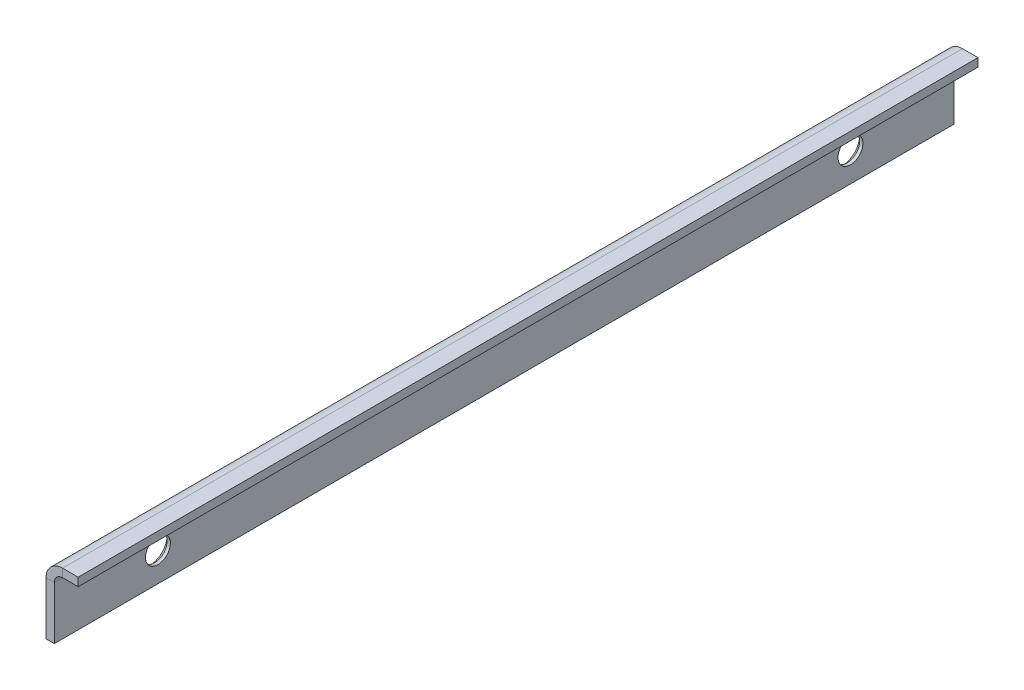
ISO-10303-21;
HEADER;
FILE_DESCRIPTION(('STEP AP214'),'2;1');
FILE_NAME('part.step','',(''),(''),'','','');
FILE_SCHEMA(('AUTOMOTIVE_DESIGN { 1 0 10303 214 1 1 1 1 }'));
ENDSEC;
DATA;
#1=APPLICATION_CONTEXT('core data for automotive mechanical design processes');
#2=APPLICATION_PROTOCOL_DEFINITION('international standard','automotive_design',2000,#1);
#3=PRODUCT_CONTEXT('',#1,'mechanical');
#4=PRODUCT('Part','Part','',(#3));
#5=PRODUCT_RELATED_PRODUCT_CATEGORY('part','',(#4));
#6=PRODUCT_DEFINITION_FORMATION('','',#4);
#7=PRODUCT_DEFINITION_CONTEXT('part definition',#1,'design');
#8=PRODUCT_DEFINITION('design','',#6,#7);
#9=PRODUCT_DEFINITION_SHAPE('','',#8);
#10=(LENGTH_UNIT() NAMED_UNIT(*) SI_UNIT(.MILLI.,.METRE.));
#11=(NAMED_UNIT(*) PLANE_ANGLE_UNIT() SI_UNIT($,.RADIAN.));
#12=(NAMED_UNIT(*) SI_UNIT($,.STERADIAN.) SOLID_ANGLE_UNIT());
#13=UNCERTAINTY_MEASURE_WITH_UNIT(LENGTH_MEASURE(1.E-05),#10,'distance_accuracy_value','');
#14=(GEOMETRIC_REPRESENTATION_CONTEXT(3) GLOBAL_UNCERTAINTY_ASSIGNED_CONTEXT((#13)) GLOBAL_UNIT_ASSIGNED_CONTEXT((#10,
#11,#12)) REPRESENTATION_CONTEXT('',''));
#15=CARTESIAN_POINT('',(0.,0.,0.));
#16=DIRECTION('',(0.,0.,1.));
#17=DIRECTION('',(1.,0.,0.));
#18=AXIS2_PLACEMENT_3D('',#15,#16,#17);
#19=CARTESIAN_POINT('',(-7.74999999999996,-14.7575225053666,217.));
#20=DIRECTION('',(-1.,0.,0.));
#21=DIRECTION('',(0.,0.,1.));
#22=AXIS2_PLACEMENT_3D('',#19,#20,#21);
#23=PLANE('',#22);
#24=CARTESIAN_POINT('',(-7.74999999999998,-7.75752250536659,192.));
#25=DIRECTION('',(-1.,0.,0.));
#26=DIRECTION('',(0.,-1.,0.));
#27=AXIS2_PLACEMENT_3D('',#24,#25,#26);
#28=CIRCLE('',#27,4.19999999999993);
#29=CARTESIAN_POINT('',(-7.74999999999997,-11.9575225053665,192.));
#30=VERTEX_POINT('',#29);
#31=EDGE_CURVE('E12',#30,#30,#28,.F.);
#32=ORIENTED_EDGE('',*,*,#31,.T.);
#33=EDGE_LOOP('',(#32));
#34=FACE_BOUND('',#33,.T.);
#35=CARTESIAN_POINT('',(-7.74999999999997,-7.75752250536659,25.));
#36=DIRECTION('',(-1.,0.,0.));
#37=DIRECTION('',(0.,-1.,0.));
#38=AXIS2_PLACEMENT_3D('',#35,#36,#37);
#39=CIRCLE('',#38,4.19999999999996);
#40=CARTESIAN_POINT('',(-7.74999999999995,-11.9575225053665,25.));
#41=VERTEX_POINT('',#40);
#42=EDGE_CURVE('E131',#41,#41,#39,.F.);
#43=ORIENTED_EDGE('',*,*,#42,.T.);
#44=EDGE_LOOP('',(#43));
#45=FACE_BOUND('',#44,.T.);
#46=DIRECTION('',(0.,1.,0.));
#47=VECTOR('',#46,1.);
#48=CARTESIAN_POINT('',(-7.74999999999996,-14.7575225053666,217.));
#49=LINE('',#48,#47);
#50=CARTESIAN_POINT('',(-7.74999999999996,-14.7575225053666,217.));
#51=VERTEX_POINT('',#50);
#52=CARTESIAN_POINT('',(-7.75000000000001,-2.00000000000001,217.));
#53=VERTEX_POINT('',#52);
#54=EDGE_CURVE('E102',#51,#53,#49,.T.);
#55=ORIENTED_EDGE('',*,*,#54,.T.);
#56=DIRECTION('',(0.,0.,-1.));
#57=VECTOR('',#56,1.);
#58=CARTESIAN_POINT('',(-7.75000000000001,-2.00000000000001,217.));
#59=LINE('',#58,#57);
#60=CARTESIAN_POINT('',(-7.74999999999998,-2.00000000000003,0.));
#61=VERTEX_POINT('',#60);
#62=EDGE_CURVE('E109',#53,#61,#59,.T.);
#63=ORIENTED_EDGE('',*,*,#62,.T.);
#64=DIRECTION('',(0.,1.,0.));
#65=VECTOR('',#64,1.);
#66=CARTESIAN_POINT('',(-7.74999999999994,-14.7575225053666,0.));
#67=LINE('',#66,#65);
#68=CARTESIAN_POINT('',(-7.74999999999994,-14.7575225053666,0.));
#69=VERTEX_POINT('',#68);
#70=EDGE_CURVE('E96',#69,#61,#67,.T.);
#71=ORIENTED_EDGE('',*,*,#70,.F.);
#72=DIRECTION('',(0.,0.,-1.));
#73=VECTOR('',#72,1.);
#74=CARTESIAN_POINT('',(-7.74999999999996,-14.7575225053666,217.));
#75=LINE('',#74,#73);
#76=EDGE_CURVE('E87',#51,#69,#75,.T.);
#77=ORIENTED_EDGE('',*,*,#76,.F.);
#78=EDGE_LOOP('',(#55,#63,#71,#77));
#79=FACE_BOUND('',#78,.T.);
#80=ADVANCED_FACE('F42',(#34,#45,#79),#23,.T.);
#81=CARTESIAN_POINT('',(-5.75000000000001,6.24247749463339,0.));
#82=DIRECTION('',(0.,0.,-1.));
#83=DIRECTION('',(0.,-1.,0.));
#84=AXIS2_PLACEMENT_3D('',#81,#82,#83);
#85=PLANE('',#84);
#86=ORIENTED_EDGE('',*,*,#70,.T.);
#87=DIRECTION('',(1.,0.,0.));
#88=VECTOR('',#87,1.);
#89=CARTESIAN_POINT('',(-5.74999999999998,-2.00000000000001,0.));
#90=LINE('',#89,#88);
#91=CARTESIAN_POINT('',(-5.74999999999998,-2.00000000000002,0.));
#92=VERTEX_POINT('',#91);
#93=EDGE_CURVE('E95',#61,#92,#90,.T.);
#94=ORIENTED_EDGE('',*,*,#93,.T.);
#95=DIRECTION('',(0.,1.,0.));
#96=VECTOR('',#95,1.);
#97=CARTESIAN_POINT('',(-5.74999999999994,-14.7575225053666,0.));
#98=LINE('',#97,#96);
#99=CARTESIAN_POINT('',(-5.74999999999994,-14.7575225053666,0.));
#100=VERTEX_POINT('',#99);
#101=EDGE_CURVE('E82',#100,#92,#98,.T.);
#102=ORIENTED_EDGE('',*,*,#101,.F.);
#103=DIRECTION('',(-1.,0.,0.));
#104=VECTOR('',#103,1.);
#105=CARTESIAN_POINT('',(-5.74999999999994,-14.7575225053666,0.));
#106=LINE('',#105,#104);
#107=EDGE_CURVE('E94',#100,#69,#106,.T.);
#108=ORIENTED_EDGE('',*,*,#107,.T.);
#109=EDGE_LOOP('',(#86,#94,#102,#108));
#110=FACE_BOUND('',#109,.T.);
#111=ADVANCED_FACE('F93',(#110),#85,.T.);
#112=CARTESIAN_POINT('',(-5.74999999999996,-14.7575225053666,217.));
#113=DIRECTION('',(-1.,0.,0.));
#114=DIRECTION('',(0.,0.,1.));
#115=AXIS2_PLACEMENT_3D('',#112,#113,#114);
#116=PLANE('',#115);
#117=CARTESIAN_POINT('',(-5.74999999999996,-7.75752250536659,25.));
#118=DIRECTION('',(-1.,0.,0.));
#119=DIRECTION('',(0.,-1.,0.));
#120=AXIS2_PLACEMENT_3D('',#117,#118,#119);
#121=CIRCLE('',#120,3.);
#122=CARTESIAN_POINT('',(-5.74999999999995,-10.7575225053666,25.));
#123=VERTEX_POINT('',#122);
#124=EDGE_CURVE('E126',#123,#123,#121,.T.);
#125=ORIENTED_EDGE('',*,*,#124,.T.);
#126=EDGE_LOOP('',(#125));
#127=FACE_BOUND('',#126,.T.);
#128=CARTESIAN_POINT('',(-5.74999999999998,-7.75752250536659,192.));
#129=DIRECTION('',(-1.,0.,0.));
#130=DIRECTION('',(0.,-1.,0.));
#131=AXIS2_PLACEMENT_3D('',#128,#129,#130);
#132=CIRCLE('',#131,2.99999999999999);
#133=CARTESIAN_POINT('',(-5.74999999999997,-10.7575225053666,192.));
#134=VERTEX_POINT('',#133);
#135=EDGE_CURVE('E122',#134,#134,#132,.T.);
#136=ORIENTED_EDGE('',*,*,#135,.T.);
#137=EDGE_LOOP('',(#136));
#138=FACE_BOUND('',#137,.T.);
#139=DIRECTION('',(0.,0.,-1.));
#140=VECTOR('',#139,1.);
#141=CARTESIAN_POINT('',(-5.75000000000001,-2.00000000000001,217.));
#142=LINE('',#141,#140);
#143=CARTESIAN_POINT('',(-5.75000000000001,-2.00000000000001,217.));
#144=VERTEX_POINT('',#143);
#145=EDGE_CURVE('E115',#144,#92,#142,.T.);
#146=ORIENTED_EDGE('',*,*,#145,.F.);
#147=DIRECTION('',(0.,1.,0.));
#148=VECTOR('',#147,1.);
#149=CARTESIAN_POINT('',(-5.74999999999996,-14.7575225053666,217.));
#150=LINE('',#149,#148);
#151=CARTESIAN_POINT('',(-5.74999999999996,-14.7575225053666,217.));
#152=VERTEX_POINT('',#151);
#153=EDGE_CURVE('E85',#152,#144,#150,.T.);
#154=ORIENTED_EDGE('',*,*,#153,.F.);
#155=DIRECTION('',(0.,0.,-1.));
#156=VECTOR('',#155,1.);
#157=CARTESIAN_POINT('',(-5.74999999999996,-14.7575225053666,217.));
#158=LINE('',#157,#156);
#159=EDGE_CURVE('E66',#152,#100,#158,.T.);
#160=ORIENTED_EDGE('',*,*,#159,.T.);
#161=ORIENTED_EDGE('',*,*,#101,.T.);
#162=EDGE_LOOP('',(#146,#154,#160,#161));
#163=FACE_BOUND('',#162,.T.);
#164=ADVANCED_FACE('F80',(#127,#138,#163),#116,.F.);
#165=CARTESIAN_POINT('',(-5.74999999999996,-14.7575225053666,217.));
#166=DIRECTION('',(0.,-1.,0.));
#167=DIRECTION('',(0.,0.,1.));
#168=AXIS2_PLACEMENT_3D('',#165,#166,#167);
#169=PLANE('',#168);
#170=ORIENTED_EDGE('',*,*,#107,.F.);
#171=ORIENTED_EDGE('',*,*,#159,.F.);
#172=DIRECTION('',(-1.,0.,0.));
#173=VECTOR('',#172,1.);
#174=CARTESIAN_POINT('',(-5.74999999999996,-14.7575225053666,217.));
#175=LINE('',#174,#173);
#176=EDGE_CURVE('E88',#152,#51,#175,.T.);
#177=ORIENTED_EDGE('',*,*,#176,.T.);
#178=ORIENTED_EDGE('',*,*,#76,.T.);
#179=EDGE_LOOP('',(#170,#171,#177,#178));
#180=FACE_BOUND('',#179,.T.);
#181=ADVANCED_FACE('F99',(#180),#169,.T.);
#182=CARTESIAN_POINT('',(-5.75000000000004,6.24247749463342,217.));
#183=DIRECTION('',(0.,0.,-1.));
#184=DIRECTION('',(0.,-1.,0.));
#185=AXIS2_PLACEMENT_3D('',#182,#183,#184);
#186=PLANE('',#185);
#187=DIRECTION('',(1.,0.,0.));
#188=VECTOR('',#187,1.);
#189=CARTESIAN_POINT('',(-5.75000000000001,-2.00000000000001,217.));
#190=LINE('',#189,#188);
#191=EDGE_CURVE('E112',#53,#144,#190,.T.);
#192=ORIENTED_EDGE('',*,*,#191,.F.);
#193=ORIENTED_EDGE('',*,*,#54,.F.);
#194=ORIENTED_EDGE('',*,*,#176,.F.);
#195=ORIENTED_EDGE('',*,*,#153,.T.);
#196=EDGE_LOOP('',(#192,#193,#194,#195));
#197=FACE_BOUND('',#196,.T.);
#198=ADVANCED_FACE('F159',(#197),#186,.F.);
#199=CARTESIAN_POINT('',(0.,2.,217.));
#200=DIRECTION('',(1.,0.,0.));
#201=DIRECTION('',(0.,0.,-1.));
#202=AXIS2_PLACEMENT_3D('',#199,#200,#201);
#203=PLANE('',#202);
#204=DIRECTION('',(0.,-1.,0.));
#205=VECTOR('',#204,1.);
#206=CARTESIAN_POINT('',(0.,2.,0.));
#207=LINE('',#206,#205);
#208=CARTESIAN_POINT('',(0.,2.,0.));
#209=VERTEX_POINT('',#208);
#210=CARTESIAN_POINT('',(0.,0.,0.));
#211=VERTEX_POINT('',#210);
#212=EDGE_CURVE('E97',#209,#211,#207,.T.);
#213=ORIENTED_EDGE('',*,*,#212,.F.);
#214=DIRECTION('',(0.,0.,-1.));
#215=VECTOR('',#214,1.);
#216=CARTESIAN_POINT('',(0.,2.,217.));
#217=LINE('',#216,#215);
#218=CARTESIAN_POINT('',(0.,2.,217.));
#219=VERTEX_POINT('',#218);
#220=EDGE_CURVE('E245',#219,#209,#217,.T.);
#221=ORIENTED_EDGE('',*,*,#220,.F.);
#222=DIRECTION('',(0.,-1.,0.));
#223=VECTOR('',#222,1.);
#224=CARTESIAN_POINT('',(0.,2.,217.));
#225=LINE('',#224,#223);
#226=CARTESIAN_POINT('',(0.,0.,217.));
#227=VERTEX_POINT('',#226);
#228=EDGE_CURVE('E233',#219,#227,#225,.T.);
#229=ORIENTED_EDGE('',*,*,#228,.T.);
#230=DIRECTION('',(0.,0.,-1.));
#231=VECTOR('',#230,1.);
#232=CARTESIAN_POINT('',(0.,0.,217.));
#233=LINE('',#232,#231);
#234=EDGE_CURVE('E237',#227,#211,#233,.T.);
#235=ORIENTED_EDGE('',*,*,#234,.T.);
#236=EDGE_LOOP('',(#213,#221,#229,#235));
#237=FACE_BOUND('',#236,.T.);
#238=ADVANCED_FACE('F162',(#237),#203,.T.);
#239=CARTESIAN_POINT('',(-21.,2.,217.));
#240=DIRECTION('',(0.,1.,0.));
#241=DIRECTION('',(0.,0.,1.));
#242=AXIS2_PLACEMENT_3D('',#239,#240,#241);
#243=PLANE('',#242);
#244=DIRECTION('',(0.,0.,-1.));
#245=VECTOR('',#244,1.);
#246=CARTESIAN_POINT('',(-3.75000000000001,2.,217.));
#247=LINE('',#246,#245);
#248=CARTESIAN_POINT('',(-3.75000000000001,2.,217.));
#249=VERTEX_POINT('',#248);
#250=CARTESIAN_POINT('',(-3.74999999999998,2.,0.));
#251=VERTEX_POINT('',#250);
#252=EDGE_CURVE('E234',#249,#251,#247,.T.);
#253=ORIENTED_EDGE('',*,*,#252,.F.);
#254=DIRECTION('',(1.,0.,0.));
#255=VECTOR('',#254,1.);
#256=CARTESIAN_POINT('',(-21.,2.,217.));
#257=LINE('',#256,#255);
#258=EDGE_CURVE('E242',#249,#219,#257,.T.);
#259=ORIENTED_EDGE('',*,*,#258,.T.);
#260=ORIENTED_EDGE('',*,*,#220,.T.);
#261=DIRECTION('',(1.,0.,0.));
#262=VECTOR('',#261,1.);
#263=CARTESIAN_POINT('',(-21.,2.,0.));
#264=LINE('',#263,#262);
#265=EDGE_CURVE('E222',#251,#209,#264,.T.);
#266=ORIENTED_EDGE('',*,*,#265,.F.);
#267=EDGE_LOOP('',(#253,#259,#260,#266));
#268=FACE_BOUND('',#267,.T.);
#269=ADVANCED_FACE('F198',(#268),#243,.T.);
#270=CARTESIAN_POINT('',(0.,0.,217.));
#271=DIRECTION('',(0.,0.,-1.));
#272=DIRECTION('',(-1.,0.,0.));
#273=AXIS2_PLACEMENT_3D('',#270,#271,#272);
#274=PLANE('',#273);
#275=ORIENTED_EDGE('',*,*,#258,.F.);
#276=DIRECTION('',(0.,-1.,0.));
#277=VECTOR('',#276,1.);
#278=CARTESIAN_POINT('',(-3.75000000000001,0.,217.));
#279=LINE('',#278,#277);
#280=CARTESIAN_POINT('',(-3.75000000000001,0.,217.));
#281=VERTEX_POINT('',#280);
#282=EDGE_CURVE('E247',#249,#281,#279,.T.);
#283=ORIENTED_EDGE('',*,*,#282,.T.);
#284=DIRECTION('',(1.,0.,0.));
#285=VECTOR('',#284,1.);
#286=CARTESIAN_POINT('',(-21.,0.,217.));
#287=LINE('',#286,#285);
#288=EDGE_CURVE('E250',#281,#227,#287,.T.);
#289=ORIENTED_EDGE('',*,*,#288,.T.);
#290=ORIENTED_EDGE('',*,*,#228,.F.);
#291=EDGE_LOOP('',(#275,#283,#289,#290));
#292=FACE_BOUND('',#291,.T.);
#293=ADVANCED_FACE('F202',(#292),#274,.F.);
#294=CARTESIAN_POINT('',(-21.,0.,217.));
#295=DIRECTION('',(0.,1.,0.));
#296=DIRECTION('',(0.,0.,1.));
#297=AXIS2_PLACEMENT_3D('',#294,#295,#296);
#298=PLANE('',#297);
#299=ORIENTED_EDGE('',*,*,#288,.F.);
#300=DIRECTION('',(0.,0.,-1.));
#301=VECTOR('',#300,1.);
#302=CARTESIAN_POINT('',(-3.75000000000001,0.,217.));
#303=LINE('',#302,#301);
#304=CARTESIAN_POINT('',(-3.74999999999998,0.,0.));
#305=VERTEX_POINT('',#304);
#306=EDGE_CURVE('E253',#281,#305,#303,.T.);
#307=ORIENTED_EDGE('',*,*,#306,.T.);
#308=DIRECTION('',(1.,0.,0.));
#309=VECTOR('',#308,1.);
#310=CARTESIAN_POINT('',(-21.,0.,0.));
#311=LINE('',#310,#309);
#312=EDGE_CURVE('E226',#305,#211,#311,.T.);
#313=ORIENTED_EDGE('',*,*,#312,.T.);
#314=ORIENTED_EDGE('',*,*,#234,.F.);
#315=EDGE_LOOP('',(#299,#307,#313,#314));
#316=FACE_BOUND('',#315,.T.);
#317=ADVANCED_FACE('F206',(#316),#298,.F.);
#318=CARTESIAN_POINT('',(0.,0.,0.));
#319=DIRECTION('',(0.,0.,-1.));
#320=DIRECTION('',(-1.,0.,0.));
#321=AXIS2_PLACEMENT_3D('',#318,#319,#320);
#322=PLANE('',#321);
#323=DIRECTION('',(0.,-1.,0.));
#324=VECTOR('',#323,1.);
#325=CARTESIAN_POINT('',(-3.74999999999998,0.,0.));
#326=LINE('',#325,#324);
#327=EDGE_CURVE('E219',#251,#305,#326,.T.);
#328=ORIENTED_EDGE('',*,*,#327,.F.);
#329=ORIENTED_EDGE('',*,*,#265,.T.);
#330=ORIENTED_EDGE('',*,*,#212,.T.);
#331=ORIENTED_EDGE('',*,*,#312,.F.);
#332=EDGE_LOOP('',(#328,#329,#330,#331));
#333=FACE_BOUND('',#332,.T.);
#334=ADVANCED_FACE('F191',(#333),#322,.T.);
#335=CARTESIAN_POINT('',(-3.75000000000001,-2.,217.));
#336=DIRECTION('',(0.,0.,1.));
#337=DIRECTION('',(1.,0.,0.));
#338=AXIS2_PLACEMENT_3D('',#335,#336,#337);
#339=PLANE('',#338);
#340=ORIENTED_EDGE('',*,*,#191,.T.);
#341=CARTESIAN_POINT('',(-3.75000000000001,-2.,217.));
#342=DIRECTION('',(0.,0.,1.));
#343=DIRECTION('',(1.,0.,0.));
#344=AXIS2_PLACEMENT_3D('',#341,#342,#343);
#345=CIRCLE('',#344,2.);
#346=EDGE_CURVE('E125',#144,#281,#345,.F.);
#347=ORIENTED_EDGE('',*,*,#346,.T.);
#348=ORIENTED_EDGE('',*,*,#282,.F.);
#349=CARTESIAN_POINT('',(-3.75000000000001,-2.,217.));
#350=DIRECTION('',(0.,0.,-1.));
#351=DIRECTION('',(-1.,0.,0.));
#352=AXIS2_PLACEMENT_3D('',#349,#350,#351);
#353=CIRCLE('',#352,4.);
#354=EDGE_CURVE('E260',#53,#249,#353,.T.);
#355=ORIENTED_EDGE('',*,*,#354,.F.);
#356=EDGE_LOOP('',(#340,#347,#348,#355));
#357=FACE_BOUND('',#356,.T.);
#358=ADVANCED_FACE('F188',(#357),#339,.T.);
#359=CARTESIAN_POINT('',(-3.74999999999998,-2.,0.));
#360=DIRECTION('',(0.,0.,-1.));
#361=DIRECTION('',(-1.,0.,0.));
#362=AXIS2_PLACEMENT_3D('',#359,#360,#361);
#363=PLANE('',#362);
#364=CARTESIAN_POINT('',(-3.74999999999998,-2.,0.));
#365=DIRECTION('',(0.,0.,1.));
#366=DIRECTION('',(1.,0.,0.));
#367=AXIS2_PLACEMENT_3D('',#364,#365,#366);
#368=CIRCLE('',#367,2.);
#369=EDGE_CURVE('E258',#305,#92,#368,.T.);
#370=ORIENTED_EDGE('',*,*,#369,.T.);
#371=ORIENTED_EDGE('',*,*,#93,.F.);
#372=CARTESIAN_POINT('',(-3.74999999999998,-2.,0.));
#373=DIRECTION('',(0.,0.,1.));
#374=DIRECTION('',(-1.,0.,0.));
#375=AXIS2_PLACEMENT_3D('',#372,#373,#374);
#376=CIRCLE('',#375,4.);
#377=EDGE_CURVE('E57',#251,#61,#376,.T.);
#378=ORIENTED_EDGE('',*,*,#377,.F.);
#379=ORIENTED_EDGE('',*,*,#327,.T.);
#380=EDGE_LOOP('',(#370,#371,#378,#379));
#381=FACE_BOUND('',#380,.T.);
#382=ADVANCED_FACE('F186',(#381),#363,.T.);
#383=CARTESIAN_POINT('',(-3.74999999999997,-2.,-108.555712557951));
#384=DIRECTION('',(0.,0.,1.));
#385=DIRECTION('',(1.,0.,0.));
#386=AXIS2_PLACEMENT_3D('',#383,#384,#385);
#387=CYLINDRICAL_SURFACE('',#386,4.);
#388=ORIENTED_EDGE('',*,*,#252,.T.);
#389=ORIENTED_EDGE('',*,*,#377,.T.);
#390=ORIENTED_EDGE('',*,*,#62,.F.);
#391=ORIENTED_EDGE('',*,*,#354,.T.);
#392=EDGE_LOOP('',(#388,#389,#390,#391));
#393=FACE_BOUND('',#392,.T.);
#394=ADVANCED_FACE('F181',(#393),#387,.T.);
#395=CARTESIAN_POINT('',(-3.74999999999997,-2.,-108.555712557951));
#396=DIRECTION('',(0.,0.,1.));
#397=DIRECTION('',(1.,0.,0.));
#398=AXIS2_PLACEMENT_3D('',#395,#396,#397);
#399=CYLINDRICAL_SURFACE('',#398,2.);
#400=ORIENTED_EDGE('',*,*,#306,.F.);
#401=ORIENTED_EDGE('',*,*,#346,.F.);
#402=ORIENTED_EDGE('',*,*,#145,.T.);
#403=ORIENTED_EDGE('',*,*,#369,.F.);
#404=EDGE_LOOP('',(#400,#401,#402,#403));
#405=FACE_BOUND('',#404,.T.);
#406=ADVANCED_FACE('F173',(#405),#399,.F.);
#407=CARTESIAN_POINT('',(2.25000000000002,-7.75752250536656,192.));
#408=DIRECTION('',(-1.,0.,0.));
#409=DIRECTION('',(0.,-1.,0.));
#410=AXIS2_PLACEMENT_3D('',#407,#408,#409);
#411=CYLINDRICAL_SURFACE('',#410,2.99999999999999);
#412=CARTESIAN_POINT('',(-6.55000000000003,-7.75752250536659,192.));
#413=DIRECTION('',(-1.,0.,0.));
#414=DIRECTION('',(0.,-1.,0.));
#415=AXIS2_PLACEMENT_3D('',#412,#413,#414);
#416=CIRCLE('',#415,2.99999999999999);
#417=CARTESIAN_POINT('',(-6.55000000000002,-10.7575225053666,192.));
#418=VERTEX_POINT('',#417);
#419=EDGE_CURVE('E50',#418,#418,#416,.T.);
#420=ORIENTED_EDGE('',*,*,#419,.T.);
#421=EDGE_LOOP('',(#420));
#422=FACE_BOUND('',#421,.T.);
#423=ORIENTED_EDGE('',*,*,#135,.F.);
#424=EDGE_LOOP('',(#423));
#425=FACE_BOUND('',#424,.T.);
#426=ADVANCED_FACE('F136',(#422,#425),#411,.F.);
#427=CARTESIAN_POINT('',(2.25000000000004,-7.75752250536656,25.));
#428=DIRECTION('',(-1.,0.,0.));
#429=DIRECTION('',(0.,-1.,0.));
#430=AXIS2_PLACEMENT_3D('',#427,#428,#429);
#431=CYLINDRICAL_SURFACE('',#430,3.);
#432=CARTESIAN_POINT('',(-6.55000000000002,-7.75752250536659,25.));
#433=DIRECTION('',(-1.,0.,0.));
#434=DIRECTION('',(0.,-1.,0.));
#435=AXIS2_PLACEMENT_3D('',#432,#433,#434);
#436=CIRCLE('',#435,3.);
#437=CARTESIAN_POINT('',(-6.55000000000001,-10.7575225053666,25.));
#438=VERTEX_POINT('',#437);
#439=EDGE_CURVE('E118',#438,#438,#436,.T.);
#440=ORIENTED_EDGE('',*,*,#439,.T.);
#441=EDGE_LOOP('',(#440));
#442=FACE_BOUND('',#441,.T.);
#443=ORIENTED_EDGE('',*,*,#124,.F.);
#444=EDGE_LOOP('',(#443));
#445=FACE_BOUND('',#444,.T.);
#446=ADVANCED_FACE('F145',(#442,#445),#431,.F.);
#447=CARTESIAN_POINT('',(-6.55000000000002,-7.75752250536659,25.));
#448=DIRECTION('',(-1.,0.,0.));
#449=DIRECTION('',(0.,-1.,0.));
#450=AXIS2_PLACEMENT_3D('',#447,#448,#449);
#451=CONICAL_SURFACE('',#450,3.,0.785398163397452);
#452=ORIENTED_EDGE('',*,*,#42,.F.);
#453=EDGE_LOOP('',(#452));
#454=FACE_BOUND('',#453,.T.);
#455=ORIENTED_EDGE('',*,*,#439,.F.);
#456=EDGE_LOOP('',(#455));
#457=FACE_BOUND('',#456,.T.);
#458=ADVANCED_FACE('F140',(#454,#457),#451,.F.);
#459=CARTESIAN_POINT('',(-6.55000000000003,-7.75752250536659,192.));
#460=DIRECTION('',(-1.,0.,0.));
#461=DIRECTION('',(0.,-1.,0.));
#462=AXIS2_PLACEMENT_3D('',#459,#460,#461);
#463=CONICAL_SURFACE('',#462,2.99999999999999,0.785398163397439);
#464=ORIENTED_EDGE('',*,*,#31,.F.);
#465=EDGE_LOOP('',(#464));
#466=FACE_BOUND('',#465,.T.);
#467=ORIENTED_EDGE('',*,*,#419,.F.);
#468=EDGE_LOOP('',(#467));
#469=FACE_BOUND('',#468,.T.);
#470=ADVANCED_FACE('F44',(#466,#469),#463,.F.);
#471=CLOSED_SHELL('',(#80,#111,#164,#181,#198,#238,#269,#293,#317,#334,#358,#382,#394,#406,#426,
#446,#458,#470));
#472=MANIFOLD_SOLID_BREP('B2',#471);
#473=ADVANCED_BREP_SHAPE_REPRESENTATION('',(#18,#472),#14);
#474=SHAPE_DEFINITION_REPRESENTATION(#9,#473);
ENDSEC;
END-ISO-10303-21;
